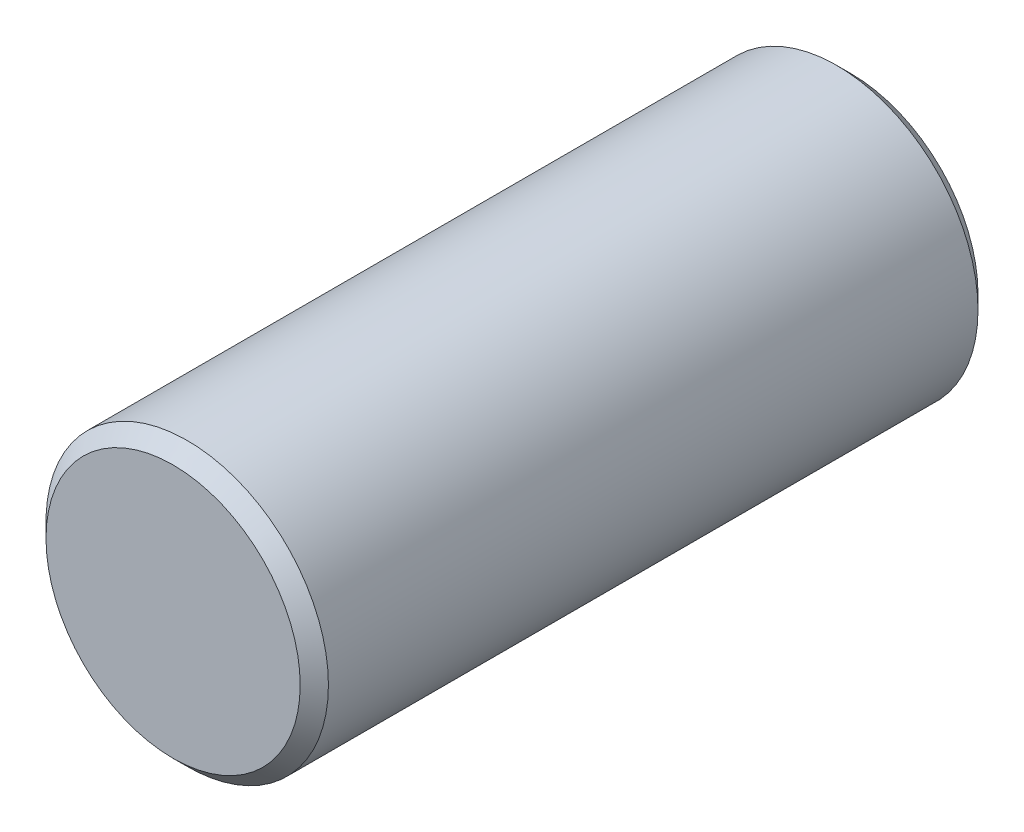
ISO-10303-21;
HEADER;
FILE_DESCRIPTION(('STEP AP214'),'2;1');
FILE_NAME('part.step','',(''),(''),'','','');
FILE_SCHEMA(('AUTOMOTIVE_DESIGN { 1 0 10303 214 1 1 1 1 }'));
ENDSEC;
DATA;
#1=APPLICATION_CONTEXT('core data for automotive mechanical design processes');
#2=APPLICATION_PROTOCOL_DEFINITION('international standard','automotive_design',2000,#1);
#3=PRODUCT_CONTEXT('',#1,'mechanical');
#4=PRODUCT('Part','Part','',(#3));
#5=PRODUCT_RELATED_PRODUCT_CATEGORY('part','',(#4));
#6=PRODUCT_DEFINITION_FORMATION('','',#4);
#7=PRODUCT_DEFINITION_CONTEXT('part definition',#1,'design');
#8=PRODUCT_DEFINITION('design','',#6,#7);
#9=PRODUCT_DEFINITION_SHAPE('','',#8);
#10=(LENGTH_UNIT() NAMED_UNIT(*) SI_UNIT(.MILLI.,.METRE.));
#11=(NAMED_UNIT(*) PLANE_ANGLE_UNIT() SI_UNIT($,.RADIAN.));
#12=(NAMED_UNIT(*) SI_UNIT($,.STERADIAN.) SOLID_ANGLE_UNIT());
#13=UNCERTAINTY_MEASURE_WITH_UNIT(LENGTH_MEASURE(1.E-05),#10,'distance_accuracy_value','');
#14=(GEOMETRIC_REPRESENTATION_CONTEXT(3) GLOBAL_UNCERTAINTY_ASSIGNED_CONTEXT((#13)) GLOBAL_UNIT_ASSIGNED_CONTEXT((#10,
#11,#12)) REPRESENTATION_CONTEXT('',''));
#15=CARTESIAN_POINT('',(0.,0.,0.));
#16=DIRECTION('',(0.,0.,1.));
#17=DIRECTION('',(1.,0.,0.));
#18=AXIS2_PLACEMENT_3D('',#15,#16,#17);
#19=CARTESIAN_POINT('',(0.,0.,12.));
#20=DIRECTION('',(0.,0.,-1.));
#21=DIRECTION('',(-1.,0.,0.));
#22=AXIS2_PLACEMENT_3D('',#19,#20,#21);
#23=CYLINDRICAL_SURFACE('',#22,2.5);
#24=CARTESIAN_POINT('',(0.,0.,11.75));
#25=DIRECTION('',(0.,0.,1.));
#26=DIRECTION('',(1.,0.,0.));
#27=AXIS2_PLACEMENT_3D('',#24,#25,#26);
#28=CIRCLE('',#27,2.5);
#29=CARTESIAN_POINT('',(2.5,0.,11.75));
#30=VERTEX_POINT('',#29);
#31=EDGE_CURVE('E42',#30,#30,#28,.F.);
#32=ORIENTED_EDGE('',*,*,#31,.T.);
#33=EDGE_LOOP('',(#32));
#34=FACE_BOUND('',#33,.T.);
#35=CARTESIAN_POINT('',(0.,0.,0.250000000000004));
#36=DIRECTION('',(0.,0.,1.));
#37=DIRECTION('',(1.,0.,0.));
#38=AXIS2_PLACEMENT_3D('',#35,#36,#37);
#39=CIRCLE('',#38,2.5);
#40=CARTESIAN_POINT('',(2.5,0.,0.250000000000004));
#41=VERTEX_POINT('',#40);
#42=EDGE_CURVE('E46',#41,#41,#39,.T.);
#43=ORIENTED_EDGE('',*,*,#42,.T.);
#44=EDGE_LOOP('',(#43));
#45=FACE_BOUND('',#44,.T.);
#46=ADVANCED_FACE('F35',(#34,#45),#23,.T.);
#47=CARTESIAN_POINT('',(0.,0.,12.));
#48=DIRECTION('',(0.,0.,1.));
#49=DIRECTION('',(1.,0.,0.));
#50=AXIS2_PLACEMENT_3D('',#47,#48,#49);
#51=PLANE('',#50);
#52=CARTESIAN_POINT('',(0.,0.,12.));
#53=DIRECTION('',(0.,0.,1.));
#54=DIRECTION('',(1.,0.,0.));
#55=AXIS2_PLACEMENT_3D('',#52,#53,#54);
#56=CIRCLE('',#55,2.25);
#57=CARTESIAN_POINT('',(2.25,0.,12.));
#58=VERTEX_POINT('',#57);
#59=EDGE_CURVE('E50',#58,#58,#56,.T.);
#60=ORIENTED_EDGE('',*,*,#59,.T.);
#61=EDGE_LOOP('',(#60));
#62=FACE_BOUND('',#61,.T.);
#63=ADVANCED_FACE('F56',(#62),#51,.T.);
#64=CARTESIAN_POINT('',(0.,0.,0.));
#65=DIRECTION('',(0.,0.,1.));
#66=DIRECTION('',(1.,0.,0.));
#67=AXIS2_PLACEMENT_3D('',#64,#65,#66);
#68=PLANE('',#67);
#69=CARTESIAN_POINT('',(0.,0.,0.));
#70=DIRECTION('',(0.,0.,1.));
#71=DIRECTION('',(1.,0.,0.));
#72=AXIS2_PLACEMENT_3D('',#69,#70,#71);
#73=CIRCLE('',#72,2.24999999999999);
#74=CARTESIAN_POINT('',(2.24999999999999,0.,0.));
#75=VERTEX_POINT('',#74);
#76=EDGE_CURVE('E10',#75,#75,#73,.F.);
#77=ORIENTED_EDGE('',*,*,#76,.T.);
#78=EDGE_LOOP('',(#77));
#79=FACE_BOUND('',#78,.T.);
#80=ADVANCED_FACE('F60',(#79),#68,.F.);
#81=CARTESIAN_POINT('',(0.,0.,12.));
#82=DIRECTION('',(0.,0.,-1.));
#83=DIRECTION('',(-1.,0.,0.));
#84=AXIS2_PLACEMENT_3D('',#81,#82,#83);
#85=CONICAL_SURFACE('',#84,2.25,0.785398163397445);
#86=ORIENTED_EDGE('',*,*,#31,.F.);
#87=EDGE_LOOP('',(#86));
#88=FACE_BOUND('',#87,.T.);
#89=ORIENTED_EDGE('',*,*,#59,.F.);
#90=EDGE_LOOP('',(#89));
#91=FACE_BOUND('',#90,.T.);
#92=ADVANCED_FACE('F58',(#88,#91),#85,.T.);
#93=CARTESIAN_POINT('',(0.,0.,0.250000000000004));
#94=DIRECTION('',(0.,0.,1.));
#95=DIRECTION('',(1.,0.,0.));
#96=AXIS2_PLACEMENT_3D('',#93,#94,#95);
#97=CONICAL_SURFACE('',#96,2.5,0.785398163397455);
#98=ORIENTED_EDGE('',*,*,#76,.F.);
#99=EDGE_LOOP('',(#98));
#100=FACE_BOUND('',#99,.T.);
#101=ORIENTED_EDGE('',*,*,#42,.F.);
#102=EDGE_LOOP('',(#101));
#103=FACE_BOUND('',#102,.T.);
#104=ADVANCED_FACE('F37',(#100,#103),#97,.T.);
#105=CLOSED_SHELL('',(#46,#63,#80,#92,#104));
#106=MANIFOLD_SOLID_BREP('B2',#105);
#107=ADVANCED_BREP_SHAPE_REPRESENTATION('',(#18,#106),#14);
#108=SHAPE_DEFINITION_REPRESENTATION(#9,#107);
ENDSEC;
END-ISO-10303-21;
